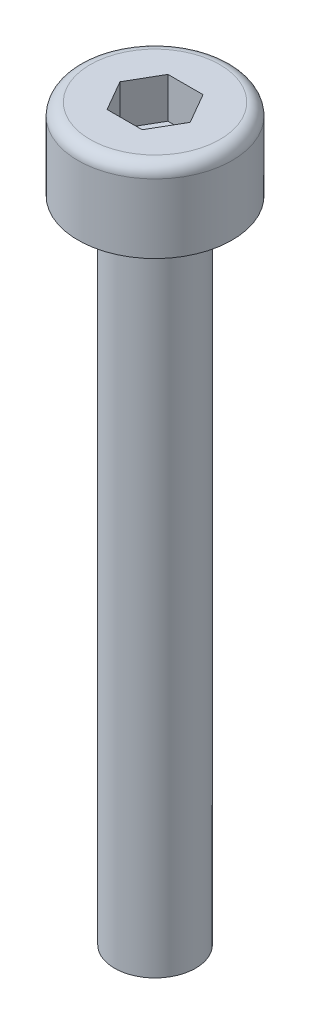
ISO-10303-21;
HEADER;
FILE_DESCRIPTION(('STEP AP214'),'2;1');
FILE_NAME('part.step','',(''),(''),'','','');
FILE_SCHEMA(('AUTOMOTIVE_DESIGN { 1 0 10303 214 1 1 1 1 }'));
ENDSEC;
DATA;
#1=APPLICATION_CONTEXT('core data for automotive mechanical design processes');
#2=APPLICATION_PROTOCOL_DEFINITION('international standard','automotive_design',2000,#1);
#3=PRODUCT_CONTEXT('',#1,'mechanical');
#4=PRODUCT('Part','Part','',(#3));
#5=PRODUCT_RELATED_PRODUCT_CATEGORY('part','',(#4));
#6=PRODUCT_DEFINITION_FORMATION('','',#4);
#7=PRODUCT_DEFINITION_CONTEXT('part definition',#1,'design');
#8=PRODUCT_DEFINITION('design','',#6,#7);
#9=PRODUCT_DEFINITION_SHAPE('','',#8);
#10=(LENGTH_UNIT() NAMED_UNIT(*) SI_UNIT(.MILLI.,.METRE.));
#11=(NAMED_UNIT(*) PLANE_ANGLE_UNIT() SI_UNIT($,.RADIAN.));
#12=(NAMED_UNIT(*) SI_UNIT($,.STERADIAN.) SOLID_ANGLE_UNIT());
#13=UNCERTAINTY_MEASURE_WITH_UNIT(LENGTH_MEASURE(1.E-05),#10,'distance_accuracy_value','');
#14=(GEOMETRIC_REPRESENTATION_CONTEXT(3) GLOBAL_UNCERTAINTY_ASSIGNED_CONTEXT((#13)) GLOBAL_UNIT_ASSIGNED_CONTEXT((#10,
#11,#12)) REPRESENTATION_CONTEXT('',''));
#15=CARTESIAN_POINT('',(0.,0.,0.));
#16=DIRECTION('',(0.,0.,1.));
#17=DIRECTION('',(1.,0.,0.));
#18=AXIS2_PLACEMENT_3D('',#15,#16,#17);
#19=CARTESIAN_POINT('',(0.,0.,0.));
#20=DIRECTION('',(0.,1.,0.));
#21=DIRECTION('',(0.,0.,1.));
#22=AXIS2_PLACEMENT_3D('',#19,#20,#21);
#23=PLANE('',#22);
#24=CARTESIAN_POINT('',(0.,0.,0.));
#25=DIRECTION('',(0.,-1.,0.));
#26=DIRECTION('',(0.,0.,-1.));
#27=AXIS2_PLACEMENT_3D('',#24,#25,#26);
#28=CIRCLE('',#27,1.);
#29=CARTESIAN_POINT('',(0.,0.,-1.));
#30=VERTEX_POINT('',#29);
#31=EDGE_CURVE('E11',#30,#30,#28,.T.);
#32=ORIENTED_EDGE('',*,*,#31,.T.);
#33=EDGE_LOOP('',(#32));
#34=FACE_BOUND('',#33,.T.);
#35=ADVANCED_FACE('F44',(#34),#23,.F.);
#36=CARTESIAN_POINT('',(0.,0.,0.));
#37=DIRECTION('',(0.,-1.,0.));
#38=DIRECTION('',(0.,0.,-1.));
#39=AXIS2_PLACEMENT_3D('',#36,#37,#38);
#40=CYLINDRICAL_SURFACE('',#39,1.);
#41=ORIENTED_EDGE('',*,*,#31,.F.);
#42=EDGE_LOOP('',(#41));
#43=FACE_BOUND('',#42,.T.);
#44=CARTESIAN_POINT('',(0.,16.,0.));
#45=DIRECTION('',(0.,-1.,0.));
#46=DIRECTION('',(0.,0.,-1.));
#47=AXIS2_PLACEMENT_3D('',#44,#45,#46);
#48=CIRCLE('',#47,1.);
#49=CARTESIAN_POINT('',(0.,16.,-1.));
#50=VERTEX_POINT('',#49);
#51=EDGE_CURVE('E52',#50,#50,#48,.T.);
#52=ORIENTED_EDGE('',*,*,#51,.T.);
#53=EDGE_LOOP('',(#52));
#54=FACE_BOUND('',#53,.T.);
#55=ADVANCED_FACE('F184',(#43,#54),#40,.T.);
#56=CARTESIAN_POINT('',(-1.,16.,0.));
#57=DIRECTION('',(0.,1.,0.));
#58=DIRECTION('',(0.,0.,1.));
#59=AXIS2_PLACEMENT_3D('',#56,#57,#58);
#60=PLANE('',#59);
#61=ORIENTED_EDGE('',*,*,#51,.F.);
#62=EDGE_LOOP('',(#61));
#63=FACE_BOUND('',#62,.T.);
#64=CARTESIAN_POINT('',(0.,16.,0.));
#65=DIRECTION('',(0.,-1.,0.));
#66=DIRECTION('',(0.,0.,-1.));
#67=AXIS2_PLACEMENT_3D('',#64,#65,#66);
#68=CIRCLE('',#67,1.9);
#69=CARTESIAN_POINT('',(0.,16.,-1.9));
#70=VERTEX_POINT('',#69);
#71=EDGE_CURVE('E176',#70,#70,#68,.T.);
#72=ORIENTED_EDGE('',*,*,#71,.T.);
#73=EDGE_LOOP('',(#72));
#74=FACE_BOUND('',#73,.T.);
#75=ADVANCED_FACE('F186',(#63,#74),#60,.F.);
#76=CARTESIAN_POINT('',(0.,0.,0.));
#77=DIRECTION('',(0.,-1.,0.));
#78=DIRECTION('',(0.,0.,-1.));
#79=AXIS2_PLACEMENT_3D('',#76,#77,#78);
#80=CYLINDRICAL_SURFACE('',#79,1.9);
#81=ORIENTED_EDGE('',*,*,#71,.F.);
#82=EDGE_LOOP('',(#81));
#83=FACE_BOUND('',#82,.T.);
#84=CARTESIAN_POINT('',(0.,17.7,0.));
#85=DIRECTION('',(0.,-1.,0.));
#86=DIRECTION('',(0.,0.,-1.));
#87=AXIS2_PLACEMENT_3D('',#84,#85,#86);
#88=CIRCLE('',#87,1.9);
#89=CARTESIAN_POINT('',(0.,17.7,-1.9));
#90=VERTEX_POINT('',#89);
#91=EDGE_CURVE('E172',#90,#90,#88,.T.);
#92=ORIENTED_EDGE('',*,*,#91,.T.);
#93=EDGE_LOOP('',(#92));
#94=FACE_BOUND('',#93,.T.);
#95=ADVANCED_FACE('F189',(#83,#94),#80,.T.);
#96=CARTESIAN_POINT('',(0.,17.7,0.));
#97=DIRECTION('',(0.,-1.,0.));
#98=DIRECTION('',(0.,0.,-1.));
#99=AXIS2_PLACEMENT_3D('',#96,#97,#98);
#100=TOROIDAL_SURFACE('',#99,1.6,0.300000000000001);
#101=ORIENTED_EDGE('',*,*,#91,.F.);
#102=EDGE_LOOP('',(#101));
#103=FACE_BOUND('',#102,.T.);
#104=CARTESIAN_POINT('',(0.,18.,0.));
#105=DIRECTION('',(0.,-1.,0.));
#106=DIRECTION('',(0.,0.,-1.));
#107=AXIS2_PLACEMENT_3D('',#104,#105,#106);
#108=CIRCLE('',#107,1.6);
#109=CARTESIAN_POINT('',(0.,18.,-1.6));
#110=VERTEX_POINT('',#109);
#111=EDGE_CURVE('E159',#110,#110,#108,.T.);
#112=ORIENTED_EDGE('',*,*,#111,.T.);
#113=EDGE_LOOP('',(#112));
#114=FACE_BOUND('',#113,.T.);
#115=ADVANCED_FACE('F195',(#103,#114),#100,.T.);
#116=CARTESIAN_POINT('',(-1.6,18.,0.));
#117=DIRECTION('',(0.,-1.,0.));
#118=DIRECTION('',(0.,0.,-1.));
#119=AXIS2_PLACEMENT_3D('',#116,#117,#118);
#120=PLANE('',#119);
#121=DIRECTION('',(-1.,0.,0.));
#122=VECTOR('',#121,1.);
#123=CARTESIAN_POINT('',(0.433012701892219,18.,-0.75));
#124=LINE('',#123,#122);
#125=CARTESIAN_POINT('',(0.433012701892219,18.,-0.75));
#126=VERTEX_POINT('',#125);
#127=CARTESIAN_POINT('',(-0.433012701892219,18.,-0.75));
#128=VERTEX_POINT('',#127);
#129=EDGE_CURVE('E140',#126,#128,#124,.T.);
#130=ORIENTED_EDGE('',*,*,#129,.F.);
#131=DIRECTION('',(-0.5,0.,-0.866025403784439));
#132=VECTOR('',#131,1.);
#133=CARTESIAN_POINT('',(0.866025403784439,18.,0.));
#134=LINE('',#133,#132);
#135=CARTESIAN_POINT('',(0.866025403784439,18.,0.));
#136=VERTEX_POINT('',#135);
#137=EDGE_CURVE('E59',#136,#126,#134,.T.);
#138=ORIENTED_EDGE('',*,*,#137,.F.);
#139=DIRECTION('',(0.5,0.,-0.866025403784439));
#140=VECTOR('',#139,1.);
#141=CARTESIAN_POINT('',(0.433012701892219,18.,0.75));
#142=LINE('',#141,#140);
#143=CARTESIAN_POINT('',(0.433012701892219,18.,0.75));
#144=VERTEX_POINT('',#143);
#145=EDGE_CURVE('E153',#144,#136,#142,.T.);
#146=ORIENTED_EDGE('',*,*,#145,.F.);
#147=DIRECTION('',(1.,0.,0.));
#148=VECTOR('',#147,1.);
#149=CARTESIAN_POINT('',(-0.433012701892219,18.,0.75));
#150=LINE('',#149,#148);
#151=CARTESIAN_POINT('',(-0.433012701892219,18.,0.75));
#152=VERTEX_POINT('',#151);
#153=EDGE_CURVE('E150',#152,#144,#150,.T.);
#154=ORIENTED_EDGE('',*,*,#153,.F.);
#155=DIRECTION('',(0.5,0.,0.866025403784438));
#156=VECTOR('',#155,1.);
#157=CARTESIAN_POINT('',(-0.866025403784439,18.,0.));
#158=LINE('',#157,#156);
#159=CARTESIAN_POINT('',(-0.866025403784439,18.,0.));
#160=VERTEX_POINT('',#159);
#161=EDGE_CURVE('E107',#160,#152,#158,.T.);
#162=ORIENTED_EDGE('',*,*,#161,.F.);
#163=DIRECTION('',(-0.5,0.,0.866025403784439));
#164=VECTOR('',#163,1.);
#165=CARTESIAN_POINT('',(-0.433012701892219,18.,-0.75));
#166=LINE('',#165,#164);
#167=EDGE_CURVE('E144',#128,#160,#166,.T.);
#168=ORIENTED_EDGE('',*,*,#167,.F.);
#169=EDGE_LOOP('',(#130,#138,#146,#154,#162,#168));
#170=FACE_BOUND('',#169,.T.);
#171=ORIENTED_EDGE('',*,*,#111,.F.);
#172=EDGE_LOOP('',(#171));
#173=FACE_BOUND('',#172,.T.);
#174=ADVANCED_FACE('F201',(#170,#173),#120,.F.);
#175=CARTESIAN_POINT('',(0.866025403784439,17.,0.));
#176=DIRECTION('',(0.866025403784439,0.,-0.5));
#177=DIRECTION('',(-0.5,0.,-0.866025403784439));
#178=AXIS2_PLACEMENT_3D('',#175,#176,#177);
#179=PLANE('',#178);
#180=ORIENTED_EDGE('',*,*,#137,.T.);
#181=DIRECTION('',(0.,1.,0.));
#182=VECTOR('',#181,1.);
#183=CARTESIAN_POINT('',(0.433012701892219,17.,-0.75));
#184=LINE('',#183,#182);
#185=CARTESIAN_POINT('',(0.433012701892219,17.,-0.75));
#186=VERTEX_POINT('',#185);
#187=EDGE_CURVE('E89',#186,#126,#184,.T.);
#188=ORIENTED_EDGE('',*,*,#187,.F.);
#189=DIRECTION('',(-0.5,0.,-0.866025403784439));
#190=VECTOR('',#189,1.);
#191=CARTESIAN_POINT('',(0.866025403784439,17.,0.));
#192=LINE('',#191,#190);
#193=CARTESIAN_POINT('',(0.866025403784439,17.,0.));
#194=VERTEX_POINT('',#193);
#195=EDGE_CURVE('E156',#194,#186,#192,.T.);
#196=ORIENTED_EDGE('',*,*,#195,.F.);
#197=DIRECTION('',(0.,1.,0.));
#198=VECTOR('',#197,1.);
#199=CARTESIAN_POINT('',(0.866025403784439,17.,0.));
#200=LINE('',#199,#198);
#201=EDGE_CURVE('E67',#194,#136,#200,.T.);
#202=ORIENTED_EDGE('',*,*,#201,.T.);
#203=EDGE_LOOP('',(#180,#188,#196,#202));
#204=FACE_BOUND('',#203,.T.);
#205=ADVANCED_FACE('F206',(#204),#179,.F.);
#206=CARTESIAN_POINT('',(0.433012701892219,17.,0.75));
#207=DIRECTION('',(0.866025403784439,0.,0.5));
#208=DIRECTION('',(0.5,0.,-0.866025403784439));
#209=AXIS2_PLACEMENT_3D('',#206,#207,#208);
#210=PLANE('',#209);
#211=ORIENTED_EDGE('',*,*,#145,.T.);
#212=ORIENTED_EDGE('',*,*,#201,.F.);
#213=DIRECTION('',(0.5,0.,-0.866025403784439));
#214=VECTOR('',#213,1.);
#215=CARTESIAN_POINT('',(0.433012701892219,17.,0.75));
#216=LINE('',#215,#214);
#217=CARTESIAN_POINT('',(0.433012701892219,17.,0.75));
#218=VERTEX_POINT('',#217);
#219=EDGE_CURVE('E121',#218,#194,#216,.T.);
#220=ORIENTED_EDGE('',*,*,#219,.F.);
#221=DIRECTION('',(0.,1.,0.));
#222=VECTOR('',#221,1.);
#223=CARTESIAN_POINT('',(0.433012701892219,17.,0.75));
#224=LINE('',#223,#222);
#225=EDGE_CURVE('E112',#218,#144,#224,.T.);
#226=ORIENTED_EDGE('',*,*,#225,.T.);
#227=EDGE_LOOP('',(#211,#212,#220,#226));
#228=FACE_BOUND('',#227,.T.);
#229=ADVANCED_FACE('F212',(#228),#210,.F.);
#230=CARTESIAN_POINT('',(-0.433012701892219,17.,0.75));
#231=DIRECTION('',(0.,0.,1.));
#232=DIRECTION('',(1.,0.,0.));
#233=AXIS2_PLACEMENT_3D('',#230,#231,#232);
#234=PLANE('',#233);
#235=ORIENTED_EDGE('',*,*,#153,.T.);
#236=ORIENTED_EDGE('',*,*,#225,.F.);
#237=DIRECTION('',(1.,0.,0.));
#238=VECTOR('',#237,1.);
#239=CARTESIAN_POINT('',(-0.433012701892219,17.,0.75));
#240=LINE('',#239,#238);
#241=CARTESIAN_POINT('',(-0.433012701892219,17.,0.75));
#242=VERTEX_POINT('',#241);
#243=EDGE_CURVE('E116',#242,#218,#240,.T.);
#244=ORIENTED_EDGE('',*,*,#243,.F.);
#245=DIRECTION('',(0.,1.,0.));
#246=VECTOR('',#245,1.);
#247=CARTESIAN_POINT('',(-0.433012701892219,17.,0.75));
#248=LINE('',#247,#246);
#249=EDGE_CURVE('E100',#242,#152,#248,.T.);
#250=ORIENTED_EDGE('',*,*,#249,.T.);
#251=EDGE_LOOP('',(#235,#236,#244,#250));
#252=FACE_BOUND('',#251,.T.);
#253=ADVANCED_FACE('F117',(#252),#234,.F.);
#254=CARTESIAN_POINT('',(-0.866025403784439,17.,0.));
#255=DIRECTION('',(-0.866025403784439,0.,0.5));
#256=DIRECTION('',(0.5,0.,0.866025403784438));
#257=AXIS2_PLACEMENT_3D('',#254,#255,#256);
#258=PLANE('',#257);
#259=ORIENTED_EDGE('',*,*,#161,.T.);
#260=ORIENTED_EDGE('',*,*,#249,.F.);
#261=DIRECTION('',(0.5,0.,0.866025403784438));
#262=VECTOR('',#261,1.);
#263=CARTESIAN_POINT('',(-0.866025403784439,17.,0.));
#264=LINE('',#263,#262);
#265=CARTESIAN_POINT('',(-0.866025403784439,17.,0.));
#266=VERTEX_POINT('',#265);
#267=EDGE_CURVE('E104',#266,#242,#264,.T.);
#268=ORIENTED_EDGE('',*,*,#267,.F.);
#269=DIRECTION('',(0.,1.,0.));
#270=VECTOR('',#269,1.);
#271=CARTESIAN_POINT('',(-0.866025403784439,17.,0.));
#272=LINE('',#271,#270);
#273=EDGE_CURVE('E113',#266,#160,#272,.T.);
#274=ORIENTED_EDGE('',*,*,#273,.T.);
#275=EDGE_LOOP('',(#259,#260,#268,#274));
#276=FACE_BOUND('',#275,.T.);
#277=ADVANCED_FACE('F102',(#276),#258,.F.);
#278=CARTESIAN_POINT('',(-0.433012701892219,17.,-0.75));
#279=DIRECTION('',(-0.866025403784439,0.,-0.5));
#280=DIRECTION('',(-0.5,0.,0.866025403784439));
#281=AXIS2_PLACEMENT_3D('',#278,#279,#280);
#282=PLANE('',#281);
#283=ORIENTED_EDGE('',*,*,#167,.T.);
#284=ORIENTED_EDGE('',*,*,#273,.F.);
#285=DIRECTION('',(-0.5,0.,0.866025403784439));
#286=VECTOR('',#285,1.);
#287=CARTESIAN_POINT('',(-0.433012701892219,17.,-0.75));
#288=LINE('',#287,#286);
#289=CARTESIAN_POINT('',(-0.433012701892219,17.,-0.75));
#290=VERTEX_POINT('',#289);
#291=EDGE_CURVE('E127',#290,#266,#288,.T.);
#292=ORIENTED_EDGE('',*,*,#291,.F.);
#293=DIRECTION('',(0.,1.,0.));
#294=VECTOR('',#293,1.);
#295=CARTESIAN_POINT('',(-0.433012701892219,17.,-0.75));
#296=LINE('',#295,#294);
#297=EDGE_CURVE('E164',#290,#128,#296,.T.);
#298=ORIENTED_EDGE('',*,*,#297,.T.);
#299=EDGE_LOOP('',(#283,#284,#292,#298));
#300=FACE_BOUND('',#299,.T.);
#301=ADVANCED_FACE('F271',(#300),#282,.F.);
#302=CARTESIAN_POINT('',(0.433012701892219,17.,-0.75));
#303=DIRECTION('',(0.,0.,-1.));
#304=DIRECTION('',(-1.,0.,0.));
#305=AXIS2_PLACEMENT_3D('',#302,#303,#304);
#306=PLANE('',#305);
#307=ORIENTED_EDGE('',*,*,#129,.T.);
#308=ORIENTED_EDGE('',*,*,#297,.F.);
#309=DIRECTION('',(-1.,0.,0.));
#310=VECTOR('',#309,1.);
#311=CARTESIAN_POINT('',(0.433012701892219,17.,-0.75));
#312=LINE('',#311,#310);
#313=EDGE_CURVE('E132',#186,#290,#312,.T.);
#314=ORIENTED_EDGE('',*,*,#313,.F.);
#315=ORIENTED_EDGE('',*,*,#187,.T.);
#316=EDGE_LOOP('',(#307,#308,#314,#315));
#317=FACE_BOUND('',#316,.T.);
#318=ADVANCED_FACE('F280',(#317),#306,.F.);
#319=CARTESIAN_POINT('',(0.,17.,0.));
#320=DIRECTION('',(0.,1.,0.));
#321=DIRECTION('',(0.,0.,1.));
#322=AXIS2_PLACEMENT_3D('',#319,#320,#321);
#323=PLANE('',#322);
#324=ORIENTED_EDGE('',*,*,#195,.T.);
#325=ORIENTED_EDGE('',*,*,#313,.T.);
#326=ORIENTED_EDGE('',*,*,#291,.T.);
#327=ORIENTED_EDGE('',*,*,#267,.T.);
#328=ORIENTED_EDGE('',*,*,#243,.T.);
#329=ORIENTED_EDGE('',*,*,#219,.T.);
#330=EDGE_LOOP('',(#324,#325,#326,#327,#328,#329));
#331=FACE_BOUND('',#330,.T.);
#332=ADVANCED_FACE('F124',(#331),#323,.T.);
#333=CLOSED_SHELL('',(#35,#55,#75,#95,#115,#174,#205,#229,#253,#277,#301,#318,#332));
#334=MANIFOLD_SOLID_BREP('B2',#333);
#335=ADVANCED_BREP_SHAPE_REPRESENTATION('',(#18,#334),#14);
#336=SHAPE_DEFINITION_REPRESENTATION(#9,#335);
ENDSEC;
END-ISO-10303-21;
